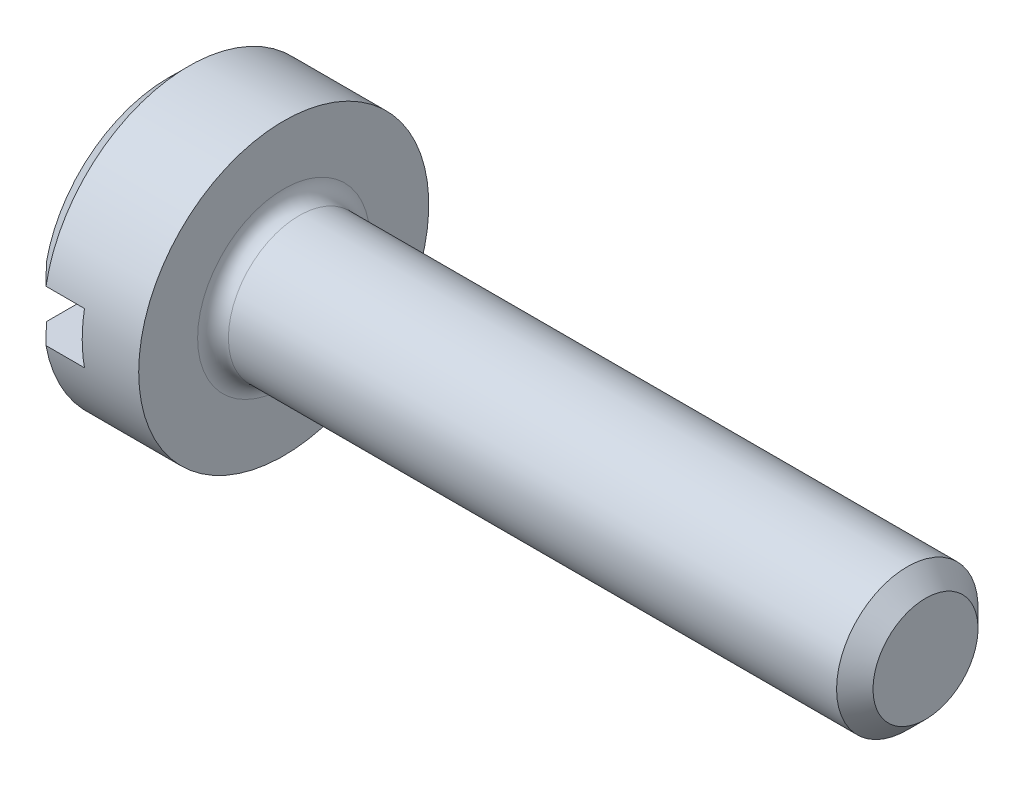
ISO-10303-21;
HEADER;
FILE_DESCRIPTION(('STEP AP214'),'2;1');
FILE_NAME('part.step','',(''),(''),'','','');
FILE_SCHEMA(('AUTOMOTIVE_DESIGN { 1 0 10303 214 1 1 1 1 }'));
ENDSEC;
DATA;
#1=APPLICATION_CONTEXT('core data for automotive mechanical design processes');
#2=APPLICATION_PROTOCOL_DEFINITION('international standard','automotive_design',2000,#1);
#3=PRODUCT_CONTEXT('',#1,'mechanical');
#4=PRODUCT('Part','Part','',(#3));
#5=PRODUCT_RELATED_PRODUCT_CATEGORY('part','',(#4));
#6=PRODUCT_DEFINITION_FORMATION('','',#4);
#7=PRODUCT_DEFINITION_CONTEXT('part definition',#1,'design');
#8=PRODUCT_DEFINITION('design','',#6,#7);
#9=PRODUCT_DEFINITION_SHAPE('','',#8);
#10=(LENGTH_UNIT() NAMED_UNIT(*) SI_UNIT(.MILLI.,.METRE.));
#11=(NAMED_UNIT(*) PLANE_ANGLE_UNIT() SI_UNIT($,.RADIAN.));
#12=(NAMED_UNIT(*) SI_UNIT($,.STERADIAN.) SOLID_ANGLE_UNIT());
#13=UNCERTAINTY_MEASURE_WITH_UNIT(LENGTH_MEASURE(1.E-05),#10,'distance_accuracy_value','');
#14=(GEOMETRIC_REPRESENTATION_CONTEXT(3) GLOBAL_UNCERTAINTY_ASSIGNED_CONTEXT((#13)) GLOBAL_UNIT_ASSIGNED_CONTEXT((#10,
#11,#12)) REPRESENTATION_CONTEXT('',''));
#15=CARTESIAN_POINT('',(0.,0.,0.));
#16=DIRECTION('',(0.,0.,1.));
#17=DIRECTION('',(1.,0.,0.));
#18=AXIS2_PLACEMENT_3D('',#15,#16,#17);
#19=CARTESIAN_POINT('',(-25.4,0.,0.));
#20=DIRECTION('',(-1.,0.,0.));
#21=DIRECTION('',(0.,0.,1.));
#22=AXIS2_PLACEMENT_3D('',#19,#20,#21);
#23=CYLINDRICAL_SURFACE('',#22,1.4351);
#24=CARTESIAN_POINT('',(1.143,0.,0.));
#25=DIRECTION('',(-1.,0.,0.));
#26=DIRECTION('',(0.,0.,1.));
#27=AXIS2_PLACEMENT_3D('',#24,#25,#26);
#28=CIRCLE('',#27,1.4351);
#29=CARTESIAN_POINT('',(1.143,0.,1.4351));
#30=VERTEX_POINT('',#29);
#31=EDGE_CURVE('E146',#30,#30,#28,.T.);
#32=ORIENTED_EDGE('',*,*,#31,.T.);
#33=EDGE_LOOP('',(#32));
#34=FACE_BOUND('',#33,.T.);
#35=CARTESIAN_POINT('',(0.203200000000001,0.,0.));
#36=DIRECTION('',(-1.,0.,0.));
#37=DIRECTION('',(0.,0.,1.));
#38=AXIS2_PLACEMENT_3D('',#35,#36,#37);
#39=CIRCLE('',#38,1.4351);
#40=CARTESIAN_POINT('',(0.203200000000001,-0.254,-1.41244327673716));
#41=VERTEX_POINT('',#40);
#42=CARTESIAN_POINT('',(0.203200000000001,-0.254,1.41244327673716));
#43=VERTEX_POINT('',#42);
#44=EDGE_CURVE('E147',#41,#43,#39,.T.);
#45=ORIENTED_EDGE('',*,*,#44,.F.);
#46=DIRECTION('',(-1.,0.,0.));
#47=VECTOR('',#46,1.);
#48=CARTESIAN_POINT('',(-25.4,-0.254,-1.41244327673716));
#49=LINE('',#48,#47);
#50=CARTESIAN_POINT('',(0.5842,-0.254,-1.41244327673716));
#51=VERTEX_POINT('',#50);
#52=EDGE_CURVE('E55',#41,#51,#49,.F.);
#53=ORIENTED_EDGE('',*,*,#52,.T.);
#54=CARTESIAN_POINT('',(0.5842,0.,0.));
#55=DIRECTION('',(-1.,0.,0.));
#56=DIRECTION('',(0.,0.,1.));
#57=AXIS2_PLACEMENT_3D('',#54,#55,#56);
#58=CIRCLE('',#57,1.4351);
#59=CARTESIAN_POINT('',(0.5842,0.254,-1.41244327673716));
#60=VERTEX_POINT('',#59);
#61=EDGE_CURVE('E96',#51,#60,#58,.F.);
#62=ORIENTED_EDGE('',*,*,#61,.T.);
#63=DIRECTION('',(-1.,0.,0.));
#64=VECTOR('',#63,1.);
#65=CARTESIAN_POINT('',(-25.4,0.254,-1.41244327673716));
#66=LINE('',#65,#64);
#67=CARTESIAN_POINT('',(0.203200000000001,0.254,-1.41244327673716));
#68=VERTEX_POINT('',#67);
#69=EDGE_CURVE('E102',#60,#68,#66,.T.);
#70=ORIENTED_EDGE('',*,*,#69,.T.);
#71=CARTESIAN_POINT('',(0.203200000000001,0.254,1.41244327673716));
#72=VERTEX_POINT('',#71);
#73=EDGE_CURVE('E107',#72,#68,#39,.T.);
#74=ORIENTED_EDGE('',*,*,#73,.F.);
#75=DIRECTION('',(-1.,0.,0.));
#76=VECTOR('',#75,1.);
#77=CARTESIAN_POINT('',(-25.4,0.254,1.41244327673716));
#78=LINE('',#77,#76);
#79=CARTESIAN_POINT('',(0.5842,0.254,1.41244327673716));
#80=VERTEX_POINT('',#79);
#81=EDGE_CURVE('E100',#72,#80,#78,.F.);
#82=ORIENTED_EDGE('',*,*,#81,.T.);
#83=CARTESIAN_POINT('',(0.5842,-0.254,1.41244327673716));
#84=VERTEX_POINT('',#83);
#85=EDGE_CURVE('E86',#80,#84,#58,.F.);
#86=ORIENTED_EDGE('',*,*,#85,.T.);
#87=DIRECTION('',(-1.,0.,0.));
#88=VECTOR('',#87,1.);
#89=CARTESIAN_POINT('',(-25.4,-0.254,1.41244327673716));
#90=LINE('',#89,#88);
#91=EDGE_CURVE('E110',#84,#43,#90,.T.);
#92=ORIENTED_EDGE('',*,*,#91,.T.);
#93=EDGE_LOOP('',(#45,#53,#62,#70,#74,#82,#86,#92));
#94=FACE_BOUND('',#93,.T.);
#95=ADVANCED_FACE('F32',(#34,#94),#23,.T.);
#96=CARTESIAN_POINT('',(0.203200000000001,0.,0.));
#97=DIRECTION('',(1.,0.,0.));
#98=DIRECTION('',(0.,0.,-1.));
#99=AXIS2_PLACEMENT_3D('',#96,#97,#98);
#100=CONICAL_SURFACE('',#99,1.4351,0.785398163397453);
#101=CARTESIAN_POINT('',(1.92983035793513,-0.254,-3.15151120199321));
#102=CARTESIAN_POINT('',(1.8180203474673,-0.254,-3.03933526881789));
#103=CARTESIAN_POINT('',(1.70622650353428,-0.254,-2.92714319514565));
#104=CARTESIAN_POINT('',(1.48268859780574,-0.254,-2.70269907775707));
#105=CARTESIAN_POINT('',(1.37094453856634,-0.254,-2.59044703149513));
#106=CARTESIAN_POINT('',(1.14740920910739,-0.254,-2.36574020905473));
#107=CARTESIAN_POINT('',(1.03561802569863,-0.254,-2.25328534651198));
#108=CARTESIAN_POINT('',(0.812160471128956,-0.254,-2.02826170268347));
#109=CARTESIAN_POINT('',(0.700494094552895,-0.254,-1.91569292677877));
#110=CARTESIAN_POINT('',(0.483186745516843,-0.254,-1.69623914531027));
#111=CARTESIAN_POINT('',(0.377535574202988,-0.254,-1.58936423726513));
#112=CARTESIAN_POINT('',(0.166530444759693,-0.254,-1.37529324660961));
#113=CARTESIAN_POINT('',(0.0611765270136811,-0.254,-1.26809712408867));
#114=CARTESIAN_POINT('',(-0.0963271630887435,-0.254,-1.10685895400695));
#115=CARTESIAN_POINT('',(-0.148722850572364,-0.254,-1.05305721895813));
#116=CARTESIAN_POINT('',(-0.253258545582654,-0.254,-0.945200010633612));
#117=CARTESIAN_POINT('',(-0.305398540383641,-0.254,-0.891144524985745));
#118=CARTESIAN_POINT('',(-0.409232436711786,-0.254,-0.782632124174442));
#119=CARTESIAN_POINT('',(-0.460926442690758,-0.254,-0.728175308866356));
#120=CARTESIAN_POINT('',(-0.563536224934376,-0.254,-0.618534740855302));
#121=CARTESIAN_POINT('',(-0.614452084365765,-0.254,-0.563351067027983));
#122=CARTESIAN_POINT('',(-0.678433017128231,-0.254,-0.491788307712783));
#123=CARTESIAN_POINT('',(-0.692305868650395,-0.254,-0.476134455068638));
#124=CARTESIAN_POINT('',(-0.719863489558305,-0.254,-0.444660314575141));
#125=CARTESIAN_POINT('',(-0.733548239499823,-0.254,-0.428840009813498));
#126=CARTESIAN_POINT('',(-0.774481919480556,-0.254,-0.380797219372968));
#127=CARTESIAN_POINT('',(-0.801369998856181,-0.254,-0.348258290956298));
#128=CARTESIAN_POINT('',(-0.840372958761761,-0.254,-0.298137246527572));
#129=CARTESIAN_POINT('',(-0.853213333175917,-0.254,-0.281122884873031));
#130=CARTESIAN_POINT('',(-0.878126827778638,-0.254,-0.246545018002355));
#131=CARTESIAN_POINT('',(-0.890200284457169,-0.254,-0.228981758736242));
#132=CARTESIAN_POINT('',(-0.913059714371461,-0.254,-0.193213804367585));
#133=CARTESIAN_POINT('',(-0.923854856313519,-0.254,-0.175015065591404));
#134=CARTESIAN_POINT('',(-0.943462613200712,-0.254,-0.137598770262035));
#135=CARTESIAN_POINT('',(-0.952281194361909,-0.254,-0.118384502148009));
#136=CARTESIAN_POINT('',(-0.964911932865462,-0.254,-0.0834460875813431));
#137=CARTESIAN_POINT('',(-0.969416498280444,-0.254,-0.067982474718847));
#138=CARTESIAN_POINT('',(-0.975741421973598,-0.254,-0.0365432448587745));
#139=CARTESIAN_POINT('',(-0.977572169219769,-0.254,-0.0205698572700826));
#140=CARTESIAN_POINT('',(-0.978147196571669,-0.254,0.0115181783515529));
#141=CARTESIAN_POINT('',(-0.976875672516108,-0.254,0.0276331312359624));
#142=CARTESIAN_POINT('',(-0.971521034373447,-0.254,0.0594103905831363));
#143=CARTESIAN_POINT('',(-0.96742866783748,-0.254,0.0750710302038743));
#144=CARTESIAN_POINT('',(-0.956985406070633,-0.254,0.106239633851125));
#145=CARTESIAN_POINT('',(-0.950555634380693,-0.254,0.121719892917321));
#146=CARTESIAN_POINT('',(-0.936202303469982,-0.254,0.151983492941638));
#147=CARTESIAN_POINT('',(-0.928275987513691,-0.254,0.16676548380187));
#148=CARTESIAN_POINT('',(-0.911370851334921,-0.254,0.195868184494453));
#149=CARTESIAN_POINT('',(-0.902383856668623,-0.254,0.210184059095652));
#150=CARTESIAN_POINT('',(-0.88373950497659,-0.254,0.238348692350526));
#151=CARTESIAN_POINT('',(-0.874082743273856,-0.254,0.252197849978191));
#152=CARTESIAN_POINT('',(-0.842628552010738,-0.254,0.295715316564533));
#153=CARTESIAN_POINT('',(-0.819961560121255,-0.254,0.324750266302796));
#154=CARTESIAN_POINT('',(-0.773519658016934,-0.254,0.381925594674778));
#155=CARTESIAN_POINT('',(-0.749744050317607,-0.254,0.41006539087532));
#156=CARTESIAN_POINT('',(-0.701506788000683,-0.254,0.46582946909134));
#157=CARTESIAN_POINT('',(-0.677044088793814,-0.254,0.493452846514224));
#158=CARTESIAN_POINT('',(-0.627711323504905,-0.254,0.548334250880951));
#159=CARTESIAN_POINT('',(-0.602841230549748,-0.254,0.575592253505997));
#160=CARTESIAN_POINT('',(-0.528014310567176,-0.254,0.656801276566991));
#161=CARTESIAN_POINT('',(-0.477662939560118,-0.254,0.710388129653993));
#162=CARTESIAN_POINT('',(-0.376484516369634,-0.254,0.817000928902));
#163=CARTESIAN_POINT('',(-0.325658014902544,-0.254,0.870027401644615));
#164=CARTESIAN_POINT('',(-0.183937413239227,-0.254,1.01702964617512));
#165=CARTESIAN_POINT('',(-0.0927121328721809,-0.254,1.11068594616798));
#166=CARTESIAN_POINT('',(0.0901708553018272,-0.254,1.29757701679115));
#167=CARTESIAN_POINT('',(0.181828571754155,-0.254,1.39081177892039));
#168=CARTESIAN_POINT('',(0.365433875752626,-0.254,1.5770886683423));
#169=CARTESIAN_POINT('',(0.457381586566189,-0.254,1.67013067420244));
#170=CARTESIAN_POINT('',(0.641422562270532,-0.254,1.85606902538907));
#171=CARTESIAN_POINT('',(0.733515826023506,-0.254,1.948965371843));
#172=CARTESIAN_POINT('',(1.00948329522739,-0.254,2.22706666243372));
#173=CARTESIAN_POINT('',(1.19349310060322,-0.254,2.41213701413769));
#174=CARTESIAN_POINT('',(1.56160711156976,-0.254,2.78198037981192));
#175=CARTESIAN_POINT('',(1.74571120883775,-0.254,2.96675350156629));
#176=CARTESIAN_POINT('',(1.92983035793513,-0.254,3.15151120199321));
#177=B_SPLINE_CURVE_WITH_KNOTS('',3,(#101,#102,#103,#104,#105,#106,#107,#108,#109,#110,#111,
#112,#113,#114,#115,#116,#117,#118,#119,#120,#121,#122,#123,#124,#125,#126,#127,#128,#129,#130,
#131,#132,#133,#134,#135,#136,#137,#138,#139,#140,#141,#142,#143,#144,#145,#146,#147,#148,#149,
#150,#151,#152,#153,#154,#155,#156,#157,#158,#159,#160,#161,#162,#163,#164,#165,#166,#167,#168,
#169,#170,#171,#172,#173,#174,#175,#176),.UNSPECIFIED.,.F.,.F.,(4,2,2,2,2,2,2,2,2,2,2,2,2,2,2,2,
2,2,2,2,2,2,2,2,2,2,2,2,2,2,2,2,2,2,2,2,2,4),(0.,0.4751466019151,0.950315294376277,
1.42601504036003,1.90169327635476,2.35253652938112,2.80343833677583,3.02873649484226,
3.25404575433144,3.47930072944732,3.70453145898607,3.76727915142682,3.830033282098,
3.95661555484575,4.0205504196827,4.08445703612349,4.14787325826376,4.21109540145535,
4.25923932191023,4.30719567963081,4.35539685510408,4.40375688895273,4.45392885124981,
4.50419415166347,4.55487581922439,4.6055130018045,4.71595123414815,4.82645991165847,
4.93714681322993,5.04784104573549,5.26842482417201,5.48877860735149,5.88100105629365,
6.27323138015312,6.66566029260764,7.05808615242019,7.84102636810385,8.62353401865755),.UNSPECIFIED.);
#178=CARTESIAN_POINT('',(0.,-0.254,-1.20543005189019));
#179=VERTEX_POINT('',#178);
#180=EDGE_CURVE('E112',#41,#179,#177,.T.);
#181=ORIENTED_EDGE('',*,*,#180,.F.);
#182=ORIENTED_EDGE('',*,*,#44,.T.);
#183=CARTESIAN_POINT('',(0.,-0.254,1.20543005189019));
#184=VERTEX_POINT('',#183);
#185=EDGE_CURVE('E108',#184,#43,#177,.T.);
#186=ORIENTED_EDGE('',*,*,#185,.F.);
#187=CARTESIAN_POINT('',(0.,0.,0.));
#188=DIRECTION('',(-1.,0.,0.));
#189=DIRECTION('',(0.,0.,1.));
#190=AXIS2_PLACEMENT_3D('',#187,#188,#189);
#191=CIRCLE('',#190,1.2319);
#192=EDGE_CURVE('E197',#179,#184,#191,.T.);
#193=ORIENTED_EDGE('',*,*,#192,.F.);
#194=EDGE_LOOP('',(#181,#182,#186,#193));
#195=FACE_BOUND('',#194,.T.);
#196=ADVANCED_FACE('F123',(#195),#100,.T.);
#197=CARTESIAN_POINT('',(1.92983035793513,0.254,3.15151120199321));
#198=CARTESIAN_POINT('',(1.8180203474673,0.254,3.03933526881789));
#199=CARTESIAN_POINT('',(1.70622650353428,0.254,2.92714319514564));
#200=CARTESIAN_POINT('',(1.48268859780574,0.254,2.70269907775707));
#201=CARTESIAN_POINT('',(1.37094453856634,0.254,2.59044703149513));
#202=CARTESIAN_POINT('',(1.14740920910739,0.254,2.36574020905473));
#203=CARTESIAN_POINT('',(1.03561802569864,0.254,2.25328534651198));
#204=CARTESIAN_POINT('',(0.812160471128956,0.254,2.02826170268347));
#205=CARTESIAN_POINT('',(0.700494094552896,0.254,1.91569292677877));
#206=CARTESIAN_POINT('',(0.483186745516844,0.254,1.69623914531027));
#207=CARTESIAN_POINT('',(0.377535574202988,0.254,1.58936423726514));
#208=CARTESIAN_POINT('',(0.166530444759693,0.254,1.37529324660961));
#209=CARTESIAN_POINT('',(0.0611765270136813,0.254,1.26809712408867));
#210=CARTESIAN_POINT('',(-0.0963271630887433,0.254,1.10685895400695));
#211=CARTESIAN_POINT('',(-0.148722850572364,0.254,1.05305721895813));
#212=CARTESIAN_POINT('',(-0.253258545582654,0.254,0.945200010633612));
#213=CARTESIAN_POINT('',(-0.305398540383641,0.254,0.891144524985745));
#214=CARTESIAN_POINT('',(-0.409232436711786,0.254,0.782632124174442));
#215=CARTESIAN_POINT('',(-0.460926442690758,0.254,0.728175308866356));
#216=CARTESIAN_POINT('',(-0.563536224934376,0.254,0.618534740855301));
#217=CARTESIAN_POINT('',(-0.614452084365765,0.254,0.563351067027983));
#218=CARTESIAN_POINT('',(-0.678433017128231,0.254,0.491788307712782));
#219=CARTESIAN_POINT('',(-0.692305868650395,0.254,0.476134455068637));
#220=CARTESIAN_POINT('',(-0.719863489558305,0.254,0.444660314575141));
#221=CARTESIAN_POINT('',(-0.733548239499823,0.254,0.428840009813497));
#222=CARTESIAN_POINT('',(-0.774481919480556,0.254,0.380797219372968));
#223=CARTESIAN_POINT('',(-0.801369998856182,0.254,0.348258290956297));
#224=CARTESIAN_POINT('',(-0.840372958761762,0.254,0.298137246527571));
#225=CARTESIAN_POINT('',(-0.853213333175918,0.254,0.28112288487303));
#226=CARTESIAN_POINT('',(-0.878126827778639,0.254,0.246545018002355));
#227=CARTESIAN_POINT('',(-0.89020028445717,0.254,0.228981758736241));
#228=CARTESIAN_POINT('',(-0.913059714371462,0.254,0.193213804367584));
#229=CARTESIAN_POINT('',(-0.92385485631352,0.254,0.175015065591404));
#230=CARTESIAN_POINT('',(-0.943462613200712,0.254,0.137598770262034));
#231=CARTESIAN_POINT('',(-0.95228119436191,0.254,0.118384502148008));
#232=CARTESIAN_POINT('',(-0.964911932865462,0.254,0.0834460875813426));
#233=CARTESIAN_POINT('',(-0.969416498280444,0.254,0.0679824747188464));
#234=CARTESIAN_POINT('',(-0.975741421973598,0.254,0.036543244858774));
#235=CARTESIAN_POINT('',(-0.977572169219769,0.254,0.0205698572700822));
#236=CARTESIAN_POINT('',(-0.978147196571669,0.254,-0.0115181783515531));
#237=CARTESIAN_POINT('',(-0.976875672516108,0.254,-0.0276331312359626));
#238=CARTESIAN_POINT('',(-0.971521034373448,0.254,-0.0594103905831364));
#239=CARTESIAN_POINT('',(-0.96742866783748,0.254,-0.0750710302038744));
#240=CARTESIAN_POINT('',(-0.956985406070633,0.254,-0.106239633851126));
#241=CARTESIAN_POINT('',(-0.950555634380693,0.254,-0.121719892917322));
#242=CARTESIAN_POINT('',(-0.936202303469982,0.254,-0.151983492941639));
#243=CARTESIAN_POINT('',(-0.928275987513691,0.254,-0.16676548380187));
#244=CARTESIAN_POINT('',(-0.911370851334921,0.254,-0.195868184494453));
#245=CARTESIAN_POINT('',(-0.902383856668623,0.254,-0.210184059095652));
#246=CARTESIAN_POINT('',(-0.883739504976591,0.254,-0.238348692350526));
#247=CARTESIAN_POINT('',(-0.874082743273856,0.254,-0.252197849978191));
#248=CARTESIAN_POINT('',(-0.842628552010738,0.254,-0.295715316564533));
#249=CARTESIAN_POINT('',(-0.819961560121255,0.254,-0.324750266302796));
#250=CARTESIAN_POINT('',(-0.773519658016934,0.254,-0.381925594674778));
#251=CARTESIAN_POINT('',(-0.749744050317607,0.254,-0.41006539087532));
#252=CARTESIAN_POINT('',(-0.701506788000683,0.254,-0.465829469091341));
#253=CARTESIAN_POINT('',(-0.677044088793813,0.254,-0.493452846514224));
#254=CARTESIAN_POINT('',(-0.627711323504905,0.254,-0.548334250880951));
#255=CARTESIAN_POINT('',(-0.602841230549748,0.254,-0.575592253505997));
#256=CARTESIAN_POINT('',(-0.528014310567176,0.254,-0.656801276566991));
#257=CARTESIAN_POINT('',(-0.477662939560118,0.254,-0.710388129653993));
#258=CARTESIAN_POINT('',(-0.376484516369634,0.254,-0.817000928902));
#259=CARTESIAN_POINT('',(-0.325658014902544,0.254,-0.870027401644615));
#260=CARTESIAN_POINT('',(-0.183937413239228,0.254,-1.01702964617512));
#261=CARTESIAN_POINT('',(-0.092712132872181,0.254,-1.11068594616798));
#262=CARTESIAN_POINT('',(0.0901708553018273,0.254,-1.29757701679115));
#263=CARTESIAN_POINT('',(0.181828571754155,0.254,-1.39081177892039));
#264=CARTESIAN_POINT('',(0.365433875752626,0.254,-1.5770886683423));
#265=CARTESIAN_POINT('',(0.45738158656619,0.254,-1.67013067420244));
#266=CARTESIAN_POINT('',(0.641422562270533,0.254,-1.85606902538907));
#267=CARTESIAN_POINT('',(0.733515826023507,0.254,-1.948965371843));
#268=CARTESIAN_POINT('',(1.00948329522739,0.254,-2.22706666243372));
#269=CARTESIAN_POINT('',(1.19349310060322,0.254,-2.41213701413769));
#270=CARTESIAN_POINT('',(1.56160711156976,0.254,-2.78198037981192));
#271=CARTESIAN_POINT('',(1.74571120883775,0.254,-2.96675350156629));
#272=CARTESIAN_POINT('',(1.92983035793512,0.254,-3.15151120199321));
#273=B_SPLINE_CURVE_WITH_KNOTS('',3,(#197,#198,#199,#200,#201,#202,#203,#204,#205,#206,#207,
#208,#209,#210,#211,#212,#213,#214,#215,#216,#217,#218,#219,#220,#221,#222,#223,#224,#225,#226,
#227,#228,#229,#230,#231,#232,#233,#234,#235,#236,#237,#238,#239,#240,#241,#242,#243,#244,#245,
#246,#247,#248,#249,#250,#251,#252,#253,#254,#255,#256,#257,#258,#259,#260,#261,#262,#263,#264,
#265,#266,#267,#268,#269,#270,#271,#272),.UNSPECIFIED.,.F.,.F.,(4,2,2,2,2,2,2,2,2,2,2,2,2,2,2,2,
2,2,2,2,2,2,2,2,2,2,2,2,2,2,2,2,2,2,2,2,2,4),(0.,0.475146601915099,0.950315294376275,
1.42601504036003,1.90169327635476,2.35253652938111,2.80343833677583,3.02873649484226,
3.25404575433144,3.47930072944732,3.70453145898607,3.76727915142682,3.830033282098,
3.95661555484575,4.0205504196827,4.08445703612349,4.14787325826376,4.21109540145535,
4.25923932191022,4.30719567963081,4.35539685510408,4.40375688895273,4.45392885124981,
4.50419415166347,4.55487581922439,4.6055130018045,4.71595123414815,4.82645991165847,
4.93714681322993,5.04784104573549,5.26842482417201,5.48877860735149,5.88100105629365,
6.27323138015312,6.66566029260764,7.05808615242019,7.84102636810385,8.62353401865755),.UNSPECIFIED.);
#274=CARTESIAN_POINT('',(0.,0.254,1.20543005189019));
#275=VERTEX_POINT('',#274);
#276=EDGE_CURVE('E47',#72,#275,#273,.T.);
#277=ORIENTED_EDGE('',*,*,#276,.F.);
#278=ORIENTED_EDGE('',*,*,#73,.T.);
#279=CARTESIAN_POINT('',(0.,0.254,-1.20543005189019));
#280=VERTEX_POINT('',#279);
#281=EDGE_CURVE('E114',#280,#68,#273,.T.);
#282=ORIENTED_EDGE('',*,*,#281,.F.);
#283=EDGE_CURVE('E153',#275,#280,#191,.T.);
#284=ORIENTED_EDGE('',*,*,#283,.F.);
#285=EDGE_LOOP('',(#277,#278,#282,#284));
#286=FACE_BOUND('',#285,.T.);
#287=ADVANCED_FACE('F143',(#286),#100,.T.);
#288=CARTESIAN_POINT('',(0.,0.,0.));
#289=DIRECTION('',(-1.,0.,0.));
#290=DIRECTION('',(0.,0.,1.));
#291=AXIS2_PLACEMENT_3D('',#288,#289,#290);
#292=PLANE('',#291);
#293=ORIENTED_EDGE('',*,*,#192,.T.);
#294=DIRECTION('',(0.,0.,-1.));
#295=VECTOR('',#294,1.);
#296=CARTESIAN_POINT('',(0.,-0.254,0.));
#297=LINE('',#296,#295);
#298=EDGE_CURVE('E97',#184,#179,#297,.T.);
#299=ORIENTED_EDGE('',*,*,#298,.T.);
#300=EDGE_LOOP('',(#293,#299));
#301=FACE_BOUND('',#300,.T.);
#302=ADVANCED_FACE('F187',(#301),#292,.T.);
#303=ORIENTED_EDGE('',*,*,#283,.T.);
#304=DIRECTION('',(0.,0.,1.));
#305=VECTOR('',#304,1.);
#306=CARTESIAN_POINT('',(0.,0.254,0.));
#307=LINE('',#306,#305);
#308=EDGE_CURVE('E150',#280,#275,#307,.T.);
#309=ORIENTED_EDGE('',*,*,#308,.T.);
#310=EDGE_LOOP('',(#303,#309));
#311=FACE_BOUND('',#310,.T.);
#312=ADVANCED_FACE('F182',(#311),#292,.T.);
#313=CARTESIAN_POINT('',(-25.4,0.,0.));
#314=DIRECTION('',(-1.,0.,0.));
#315=DIRECTION('',(0.,0.,1.));
#316=AXIS2_PLACEMENT_3D('',#313,#314,#315);
#317=CYLINDRICAL_SURFACE('',#316,0.69977);
#318=CARTESIAN_POINT('',(1.2954,0.,0.));
#319=DIRECTION('',(-1.,0.,0.));
#320=DIRECTION('',(0.,0.,1.));
#321=AXIS2_PLACEMENT_3D('',#318,#319,#320);
#322=CIRCLE('',#321,0.69977);
#323=CARTESIAN_POINT('',(1.2954,0.,0.69977));
#324=VERTEX_POINT('',#323);
#325=EDGE_CURVE('E11',#324,#324,#322,.F.);
#326=ORIENTED_EDGE('',*,*,#325,.T.);
#327=EDGE_LOOP('',(#326));
#328=FACE_BOUND('',#327,.T.);
#329=CARTESIAN_POINT('',(7.31266,0.,0.));
#330=DIRECTION('',(-1.,0.,0.));
#331=DIRECTION('',(0.,0.,1.));
#332=AXIS2_PLACEMENT_3D('',#329,#330,#331);
#333=CIRCLE('',#332,0.69977);
#334=CARTESIAN_POINT('',(7.31266,0.,0.69977));
#335=VERTEX_POINT('',#334);
#336=EDGE_CURVE('E192',#335,#335,#333,.T.);
#337=ORIENTED_EDGE('',*,*,#336,.T.);
#338=EDGE_LOOP('',(#337));
#339=FACE_BOUND('',#338,.T.);
#340=ADVANCED_FACE('F180',(#328,#339),#317,.T.);
#341=CARTESIAN_POINT('',(1.143,0.69977,0.));
#342=DIRECTION('',(-1.,0.,0.));
#343=DIRECTION('',(0.,0.,1.));
#344=AXIS2_PLACEMENT_3D('',#341,#342,#343);
#345=PLANE('',#344);
#346=CARTESIAN_POINT('',(1.143,0.,0.));
#347=DIRECTION('',(-1.,0.,0.));
#348=DIRECTION('',(0.,0.,1.));
#349=AXIS2_PLACEMENT_3D('',#346,#347,#348);
#350=CIRCLE('',#349,0.85217);
#351=CARTESIAN_POINT('',(1.143,0.,0.85217));
#352=VERTEX_POINT('',#351);
#353=EDGE_CURVE('E40',#352,#352,#350,.T.);
#354=ORIENTED_EDGE('',*,*,#353,.T.);
#355=EDGE_LOOP('',(#354));
#356=FACE_BOUND('',#355,.T.);
#357=ORIENTED_EDGE('',*,*,#31,.F.);
#358=EDGE_LOOP('',(#357));
#359=FACE_BOUND('',#358,.T.);
#360=ADVANCED_FACE('F162',(#356,#359),#345,.F.);
#361=CARTESIAN_POINT('',(7.493,0.51943,0.));
#362=DIRECTION('',(1.,0.,0.));
#363=DIRECTION('',(0.,0.,-1.));
#364=AXIS2_PLACEMENT_3D('',#361,#362,#363);
#365=PLANE('',#364);
#366=CARTESIAN_POINT('',(7.493,0.,0.));
#367=DIRECTION('',(-1.,0.,0.));
#368=DIRECTION('',(0.,0.,1.));
#369=AXIS2_PLACEMENT_3D('',#366,#367,#368);
#370=CIRCLE('',#369,0.51943);
#371=CARTESIAN_POINT('',(7.493,0.,0.51943));
#372=VERTEX_POINT('',#371);
#373=EDGE_CURVE('E194',#372,#372,#370,.T.);
#374=ORIENTED_EDGE('',*,*,#373,.F.);
#375=EDGE_LOOP('',(#374));
#376=FACE_BOUND('',#375,.T.);
#377=ADVANCED_FACE('F179',(#376),#365,.T.);
#378=CARTESIAN_POINT('',(7.31266,0.,0.));
#379=DIRECTION('',(-1.,0.,0.));
#380=DIRECTION('',(0.,0.,1.));
#381=AXIS2_PLACEMENT_3D('',#378,#379,#380);
#382=CONICAL_SURFACE('',#381,0.69977,0.785398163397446);
#383=ORIENTED_EDGE('',*,*,#373,.T.);
#384=EDGE_LOOP('',(#383));
#385=FACE_BOUND('',#384,.T.);
#386=ORIENTED_EDGE('',*,*,#336,.F.);
#387=EDGE_LOOP('',(#386));
#388=FACE_BOUND('',#387,.T.);
#389=ADVANCED_FACE('F132',(#385,#388),#382,.T.);
#390=CARTESIAN_POINT('',(0.,-0.254,-1.4351));
#391=DIRECTION('',(0.,1.,0.));
#392=DIRECTION('',(0.,0.,1.));
#393=AXIS2_PLACEMENT_3D('',#390,#391,#392);
#394=PLANE('',#393);
#395=ORIENTED_EDGE('',*,*,#180,.T.);
#396=ORIENTED_EDGE('',*,*,#298,.F.);
#397=ORIENTED_EDGE('',*,*,#185,.T.);
#398=ORIENTED_EDGE('',*,*,#91,.F.);
#399=DIRECTION('',(0.,0.,1.));
#400=VECTOR('',#399,1.);
#401=CARTESIAN_POINT('',(0.5842,-0.254,-1.4351));
#402=LINE('',#401,#400);
#403=EDGE_CURVE('E91',#51,#84,#402,.T.);
#404=ORIENTED_EDGE('',*,*,#403,.F.);
#405=ORIENTED_EDGE('',*,*,#52,.F.);
#406=EDGE_LOOP('',(#395,#396,#397,#398,#404,#405));
#407=FACE_BOUND('',#406,.T.);
#408=ADVANCED_FACE('F127',(#407),#394,.T.);
#409=CARTESIAN_POINT('',(0.,0.254,1.4351));
#410=DIRECTION('',(0.,-1.,0.));
#411=DIRECTION('',(0.,0.,-1.));
#412=AXIS2_PLACEMENT_3D('',#409,#410,#411);
#413=PLANE('',#412);
#414=ORIENTED_EDGE('',*,*,#276,.T.);
#415=ORIENTED_EDGE('',*,*,#308,.F.);
#416=ORIENTED_EDGE('',*,*,#281,.T.);
#417=ORIENTED_EDGE('',*,*,#69,.F.);
#418=DIRECTION('',(0.,0.,-1.));
#419=VECTOR('',#418,1.);
#420=CARTESIAN_POINT('',(0.5842,0.254,1.4351));
#421=LINE('',#420,#419);
#422=EDGE_CURVE('E89',#80,#60,#421,.T.);
#423=ORIENTED_EDGE('',*,*,#422,.F.);
#424=ORIENTED_EDGE('',*,*,#81,.F.);
#425=EDGE_LOOP('',(#414,#415,#416,#417,#423,#424));
#426=FACE_BOUND('',#425,.T.);
#427=ADVANCED_FACE('F99',(#426),#413,.T.);
#428=CARTESIAN_POINT('',(0.5842,0.254,-1.4351));
#429=DIRECTION('',(-1.,0.,0.));
#430=DIRECTION('',(0.,0.,1.));
#431=AXIS2_PLACEMENT_3D('',#428,#429,#430);
#432=PLANE('',#431);
#433=ORIENTED_EDGE('',*,*,#403,.T.);
#434=ORIENTED_EDGE('',*,*,#85,.F.);
#435=ORIENTED_EDGE('',*,*,#422,.T.);
#436=ORIENTED_EDGE('',*,*,#61,.F.);
#437=EDGE_LOOP('',(#433,#434,#435,#436));
#438=FACE_BOUND('',#437,.T.);
#439=ADVANCED_FACE('F88',(#438),#432,.T.);
#440=CARTESIAN_POINT('',(1.2954,0.,0.));
#441=DIRECTION('',(-1.,0.,0.));
#442=DIRECTION('',(0.,0.,1.));
#443=AXIS2_PLACEMENT_3D('',#440,#441,#442);
#444=TOROIDAL_SURFACE('',#443,0.85217,0.1524);
#445=ORIENTED_EDGE('',*,*,#325,.F.);
#446=EDGE_LOOP('',(#445));
#447=FACE_BOUND('',#446,.T.);
#448=ORIENTED_EDGE('',*,*,#353,.F.);
#449=EDGE_LOOP('',(#448));
#450=FACE_BOUND('',#449,.T.);
#451=ADVANCED_FACE('F34',(#447,#450),#444,.F.);
#452=CLOSED_SHELL('',(#95,#196,#287,#302,#312,#340,#360,#377,#389,#408,#427,#439,#451));
#453=MANIFOLD_SOLID_BREP('B2',#452);
#454=ADVANCED_BREP_SHAPE_REPRESENTATION('',(#18,#453),#14);
#455=SHAPE_DEFINITION_REPRESENTATION(#9,#454);
ENDSEC;
END-ISO-10303-21;
